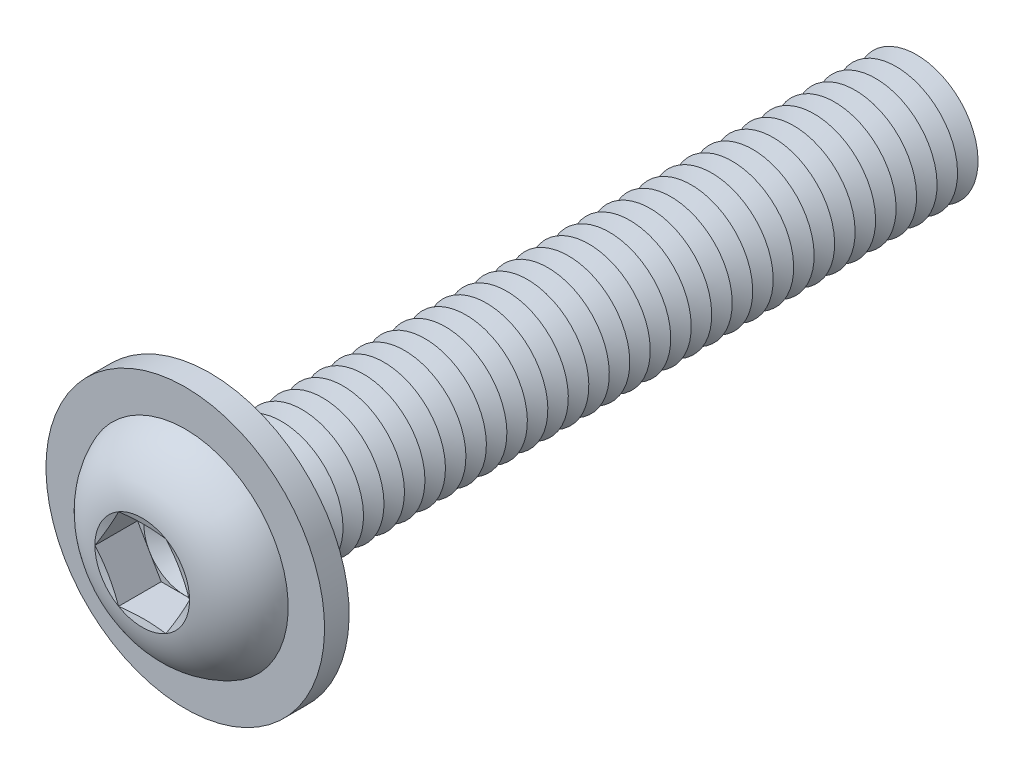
from build123d import *

# Parameters (mm, degrees)
FILLET1_R           = 0.5
LPATTERN1_COUNT     = 35
LPATTERN1_PITCH     = 1
CUT_EXTRUDE1_DEPTH  = 2.08
SKETCH5_R           = 6.8
SKETCH5_R_2         = 3.5
BOSS_EXTRUDE1_DEPTH = 1.2


with BuildPart() as part:
    # Sketch1 → Revolve1 (revolve)
    with BuildSketch(Plane(origin=(0, 0, 0), x_dir=(0, 0, -1), z_dir=(1, 0, 0))):
        with BuildLine():
            Line((0, 3), (0, 5.25))
            ThreePointArc((0, 5.25), (-2.210041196, 4.408189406), (-3.3, 2.3094))
            Line((-3.3, 2.3094), (-2.990599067, 1.1547))
            Line((-2.990599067, 1.1547), (-3.3, 1.1547))
            Line((-3.3, 1.1547), (-3.3, 0))
            Line((-3.3, 0), (35, 0))
            Line((35, 0), (35, 3))
            Line((35, 3), (0, 3))
        make_face()
    revolve(axis=Axis((0, 0, -35), (0, 0, 1)))

    # Fillet1
    fillet1_edges = [part.edges().sort_by_distance(p)[0] for p in [
        (0, -3, 0),
    ]]
    fillet(fillet1_edges, radius=FILLET1_R)

    # Sketch2 → Cut-Revolve1 (revolve, cut)
    with BuildSketch(Plane(origin=(0, 0, 0), x_dir=(0, 0, -1), z_dir=(1, 0, 0))):
        Polygon((34.5, 3), (35.5, 3), (35, 2.133974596), align=None)
    cut_revolve1 = revolve(axis=Axis((0, 0, -35), (0, 0, -1)), mode=Mode.SUBTRACT)

    # LPattern1: Cut-Revolve1 ×35
    with Locations(*[(0, 0, i * LPATTERN1_PITCH) for i in range(1, LPATTERN1_COUNT)]):
        add(cut_revolve1, mode=Mode.SUBTRACT)

    # Sketch3 → Cut-Extrude1 (cut)
    with BuildSketch(Plane.XY.offset(3.3)):
        Polygon((1.1547, 1.999999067), (-1.1547, 1.999999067), (-2.3094, 0), (-1.1547, -1.999999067), (1.1547, -1.999999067), (2.3094, 0), align=None)
    extrude(amount=-CUT_EXTRUDE1_DEPTH, mode=Mode.SUBTRACT)

    # Cut-Extrude2 cone 1 section (on through the dimple's axis) → Cut-Extrude2 (revolve, cut)
    with BuildSketch(Plane(origin=(0, 0, 1.22), x_dir=(0, -1, 0), z_dir=(1, 0, 0))):
        Polygon((0, 0), (1.999999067, 0), (0, 1.1547), align=None)
    revolve(axis=Axis((0, 0, 1.22), (0, 0, -1)), mode=Mode.SUBTRACT)

    # Sketch5 → Boss-Extrude1 (add)
    with BuildSketch(Plane(origin=(0, 0, 0), x_dir=(-1, 0, 0), z_dir=(0, 0, -1))):
        with Locations(Location((0, 0, 0), (0, 0, 90))):
            Circle(SKETCH5_R)
        Circle(SKETCH5_R_2, mode=Mode.SUBTRACT)
    extrude(amount=-BOSS_EXTRUDE1_DEPTH)


solid = part.part
